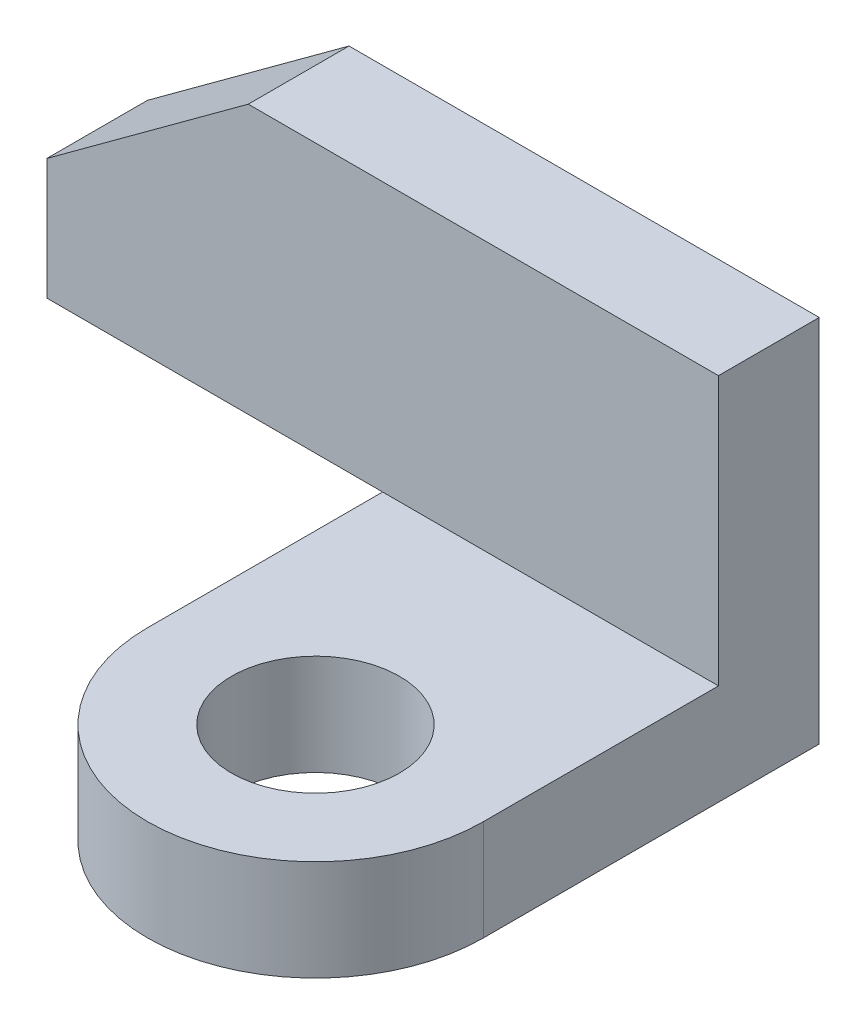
ISO-10303-21;
HEADER;
FILE_DESCRIPTION(('STEP AP214'),'2;1');
FILE_NAME('part.step','',(''),(''),'','','');
FILE_SCHEMA(('AUTOMOTIVE_DESIGN { 1 0 10303 214 1 1 1 1 }'));
ENDSEC;
DATA;
#1=APPLICATION_CONTEXT('core data for automotive mechanical design processes');
#2=APPLICATION_PROTOCOL_DEFINITION('international standard','automotive_design',2000,#1);
#3=PRODUCT_CONTEXT('',#1,'mechanical');
#4=PRODUCT('Part','Part','',(#3));
#5=PRODUCT_RELATED_PRODUCT_CATEGORY('part','',(#4));
#6=PRODUCT_DEFINITION_FORMATION('','',#4);
#7=PRODUCT_DEFINITION_CONTEXT('part definition',#1,'design');
#8=PRODUCT_DEFINITION('design','',#6,#7);
#9=PRODUCT_DEFINITION_SHAPE('','',#8);
#10=(LENGTH_UNIT() NAMED_UNIT(*) SI_UNIT(.MILLI.,.METRE.));
#11=(NAMED_UNIT(*) PLANE_ANGLE_UNIT() SI_UNIT($,.RADIAN.));
#12=(NAMED_UNIT(*) SI_UNIT($,.STERADIAN.) SOLID_ANGLE_UNIT());
#13=UNCERTAINTY_MEASURE_WITH_UNIT(LENGTH_MEASURE(1.E-05),#10,'distance_accuracy_value','');
#14=(GEOMETRIC_REPRESENTATION_CONTEXT(3) GLOBAL_UNCERTAINTY_ASSIGNED_CONTEXT((#13)) GLOBAL_UNIT_ASSIGNED_CONTEXT((#10,
#11,#12)) REPRESENTATION_CONTEXT('',''));
#15=CARTESIAN_POINT('',(0.,0.,0.));
#16=DIRECTION('',(0.,0.,1.));
#17=DIRECTION('',(1.,0.,0.));
#18=AXIS2_PLACEMENT_3D('',#15,#16,#17);
#19=CARTESIAN_POINT('',(-25.,-15.,50.));
#20=DIRECTION('',(0.,1.,0.));
#21=DIRECTION('',(-1.,0.,0.));
#22=AXIS2_PLACEMENT_3D('',#19,#20,#21);
#23=CYLINDRICAL_SURFACE('',#22,25.);
#24=DIRECTION('',(0.,1.,0.));
#25=VECTOR('',#24,1.);
#26=CARTESIAN_POINT('',(-50.,-15.,50.));
#27=LINE('',#26,#25);
#28=CARTESIAN_POINT('',(-50.,-15.,50.));
#29=VERTEX_POINT('',#28);
#30=CARTESIAN_POINT('',(-50.,0.,50.));
#31=VERTEX_POINT('',#30);
#32=EDGE_CURVE('E157',#29,#31,#27,.T.);
#33=ORIENTED_EDGE('',*,*,#32,.F.);
#34=CARTESIAN_POINT('',(-25.,-15.,50.));
#35=DIRECTION('',(0.,-1.,0.));
#36=DIRECTION('',(1.,0.,0.));
#37=AXIS2_PLACEMENT_3D('',#34,#35,#36);
#38=CIRCLE('',#37,25.);
#39=CARTESIAN_POINT('',(0.,-15.,50.));
#40=VERTEX_POINT('',#39);
#41=EDGE_CURVE('E37',#40,#29,#38,.T.);
#42=ORIENTED_EDGE('',*,*,#41,.F.);
#43=DIRECTION('',(0.,1.,0.));
#44=VECTOR('',#43,1.);
#45=CARTESIAN_POINT('',(0.,40.,50.));
#46=LINE('',#45,#44);
#47=CARTESIAN_POINT('',(0.,0.,50.));
#48=VERTEX_POINT('',#47);
#49=EDGE_CURVE('E112',#48,#40,#46,.F.);
#50=ORIENTED_EDGE('',*,*,#49,.F.);
#51=CARTESIAN_POINT('',(-25.,0.,50.));
#52=DIRECTION('',(0.,-1.,0.));
#53=DIRECTION('',(1.,0.,0.));
#54=AXIS2_PLACEMENT_3D('',#51,#52,#53);
#55=CIRCLE('',#54,25.);
#56=EDGE_CURVE('E11',#31,#48,#55,.F.);
#57=ORIENTED_EDGE('',*,*,#56,.F.);
#58=EDGE_LOOP('',(#33,#42,#50,#57));
#59=FACE_BOUND('',#58,.T.);
#60=ADVANCED_FACE('F30',(#59),#23,.T.);
#61=CARTESIAN_POINT('',(0.,0.,15.));
#62=DIRECTION('',(0.,1.,0.));
#63=DIRECTION('',(-1.,0.,0.));
#64=AXIS2_PLACEMENT_3D('',#61,#62,#63);
#65=PLANE('',#64);
#66=DIRECTION('',(0.,0.,-1.));
#67=VECTOR('',#66,1.);
#68=CARTESIAN_POINT('',(-50.,0.,75.));
#69=LINE('',#68,#67);
#70=CARTESIAN_POINT('',(-50.,0.,15.));
#71=VERTEX_POINT('',#70);
#72=CARTESIAN_POINT('',(-50.,0.,0.));
#73=VERTEX_POINT('',#72);
#74=EDGE_CURVE('E160',#71,#73,#69,.T.);
#75=ORIENTED_EDGE('',*,*,#74,.F.);
#76=DIRECTION('',(1.,0.,0.));
#77=VECTOR('',#76,1.);
#78=CARTESIAN_POINT('',(0.,0.,15.));
#79=LINE('',#78,#77);
#80=CARTESIAN_POINT('',(-100.,0.,15.));
#81=VERTEX_POINT('',#80);
#82=EDGE_CURVE('E142',#81,#71,#79,.T.);
#83=ORIENTED_EDGE('',*,*,#82,.F.);
#84=DIRECTION('',(0.,0.,-1.));
#85=VECTOR('',#84,1.);
#86=CARTESIAN_POINT('',(-100.,0.,15.));
#87=LINE('',#86,#85);
#88=CARTESIAN_POINT('',(-100.,0.,0.));
#89=VERTEX_POINT('',#88);
#90=EDGE_CURVE('E145',#81,#89,#87,.T.);
#91=ORIENTED_EDGE('',*,*,#90,.T.);
#92=DIRECTION('',(1.,0.,0.));
#93=VECTOR('',#92,1.);
#94=CARTESIAN_POINT('',(0.,0.,0.));
#95=LINE('',#94,#93);
#96=EDGE_CURVE('E154',#89,#73,#95,.T.);
#97=ORIENTED_EDGE('',*,*,#96,.T.);
#98=EDGE_LOOP('',(#75,#83,#91,#97));
#99=FACE_BOUND('',#98,.T.);
#100=ADVANCED_FACE('F198',(#99),#65,.F.);
#101=CARTESIAN_POINT('',(0.,40.,15.));
#102=DIRECTION('',(-1.,0.,0.));
#103=DIRECTION('',(0.,-1.,0.));
#104=AXIS2_PLACEMENT_3D('',#101,#102,#103);
#105=PLANE('',#104);
#106=DIRECTION('',(0.,0.,1.));
#107=VECTOR('',#106,1.);
#108=CARTESIAN_POINT('',(0.,0.,0.));
#109=LINE('',#108,#107);
#110=CARTESIAN_POINT('',(0.,0.,15.));
#111=VERTEX_POINT('',#110);
#112=EDGE_CURVE('E122',#111,#48,#109,.T.);
#113=ORIENTED_EDGE('',*,*,#112,.T.);
#114=ORIENTED_EDGE('',*,*,#49,.T.);
#115=DIRECTION('',(0.,0.,1.));
#116=VECTOR('',#115,1.);
#117=CARTESIAN_POINT('',(0.,-15.,0.));
#118=LINE('',#117,#116);
#119=CARTESIAN_POINT('',(0.,-15.,0.));
#120=VERTEX_POINT('',#119);
#121=EDGE_CURVE('E109',#120,#40,#118,.T.);
#122=ORIENTED_EDGE('',*,*,#121,.F.);
#123=DIRECTION('',(0.,1.,0.));
#124=VECTOR('',#123,1.);
#125=CARTESIAN_POINT('',(0.,40.,0.));
#126=LINE('',#125,#124);
#127=CARTESIAN_POINT('',(0.,40.,0.));
#128=VERTEX_POINT('',#127);
#129=EDGE_CURVE('E95',#120,#128,#126,.T.);
#130=ORIENTED_EDGE('',*,*,#129,.T.);
#131=DIRECTION('',(0.,0.,-1.));
#132=VECTOR('',#131,1.);
#133=CARTESIAN_POINT('',(0.,40.,15.));
#134=LINE('',#133,#132);
#135=CARTESIAN_POINT('',(0.,40.,15.));
#136=VERTEX_POINT('',#135);
#137=EDGE_CURVE('E168',#136,#128,#134,.T.);
#138=ORIENTED_EDGE('',*,*,#137,.F.);
#139=DIRECTION('',(0.,1.,0.));
#140=VECTOR('',#139,1.);
#141=CARTESIAN_POINT('',(0.,40.,15.));
#142=LINE('',#141,#140);
#143=EDGE_CURVE('E137',#111,#136,#142,.T.);
#144=ORIENTED_EDGE('',*,*,#143,.F.);
#145=EDGE_LOOP('',(#113,#114,#122,#130,#138,#144));
#146=FACE_BOUND('',#145,.T.);
#147=ADVANCED_FACE('F111',(#146),#105,.F.);
#148=CARTESIAN_POINT('',(-70.,40.,15.));
#149=DIRECTION('',(0.,-1.,0.));
#150=DIRECTION('',(0.,0.,-1.));
#151=AXIS2_PLACEMENT_3D('',#148,#149,#150);
#152=PLANE('',#151);
#153=DIRECTION('',(-1.,0.,0.));
#154=VECTOR('',#153,1.);
#155=CARTESIAN_POINT('',(-70.,40.,0.));
#156=LINE('',#155,#154);
#157=CARTESIAN_POINT('',(-70.,40.,0.));
#158=VERTEX_POINT('',#157);
#159=EDGE_CURVE('E102',#128,#158,#156,.T.);
#160=ORIENTED_EDGE('',*,*,#159,.T.);
#161=DIRECTION('',(0.,0.,-1.));
#162=VECTOR('',#161,1.);
#163=CARTESIAN_POINT('',(-70.,40.,15.));
#164=LINE('',#163,#162);
#165=CARTESIAN_POINT('',(-70.,40.,15.));
#166=VERTEX_POINT('',#165);
#167=EDGE_CURVE('E181',#166,#158,#164,.T.);
#168=ORIENTED_EDGE('',*,*,#167,.F.);
#169=DIRECTION('',(-1.,0.,0.));
#170=VECTOR('',#169,1.);
#171=CARTESIAN_POINT('',(-70.,40.,15.));
#172=LINE('',#171,#170);
#173=EDGE_CURVE('E134',#136,#166,#172,.T.);
#174=ORIENTED_EDGE('',*,*,#173,.F.);
#175=ORIENTED_EDGE('',*,*,#137,.T.);
#176=EDGE_LOOP('',(#160,#168,#174,#175));
#177=FACE_BOUND('',#176,.T.);
#178=ADVANCED_FACE('F187',(#177),#152,.F.);
#179=CARTESIAN_POINT('',(-100.,18.,15.));
#180=DIRECTION('',(0.591363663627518,-0.806404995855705,0.));
#181=DIRECTION('',(0.806404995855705,0.591363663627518,0.));
#182=AXIS2_PLACEMENT_3D('',#179,#180,#181);
#183=PLANE('',#182);
#184=DIRECTION('',(-0.806404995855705,-0.591363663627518,0.));
#185=VECTOR('',#184,1.);
#186=CARTESIAN_POINT('',(-100.,18.,0.));
#187=LINE('',#186,#185);
#188=CARTESIAN_POINT('',(-100.,18.,0.));
#189=VERTEX_POINT('',#188);
#190=EDGE_CURVE('E200',#158,#189,#187,.T.);
#191=ORIENTED_EDGE('',*,*,#190,.T.);
#192=DIRECTION('',(0.,0.,-1.));
#193=VECTOR('',#192,1.);
#194=CARTESIAN_POINT('',(-100.,18.,15.));
#195=LINE('',#194,#193);
#196=CARTESIAN_POINT('',(-100.,18.,15.));
#197=VERTEX_POINT('',#196);
#198=EDGE_CURVE('E179',#197,#189,#195,.T.);
#199=ORIENTED_EDGE('',*,*,#198,.F.);
#200=DIRECTION('',(-0.806404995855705,-0.591363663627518,0.));
#201=VECTOR('',#200,1.);
#202=CARTESIAN_POINT('',(-100.,18.,15.));
#203=LINE('',#202,#201);
#204=EDGE_CURVE('E136',#166,#197,#203,.T.);
#205=ORIENTED_EDGE('',*,*,#204,.F.);
#206=ORIENTED_EDGE('',*,*,#167,.T.);
#207=EDGE_LOOP('',(#191,#199,#205,#206));
#208=FACE_BOUND('',#207,.T.);
#209=ADVANCED_FACE('F203',(#208),#183,.F.);
#210=CARTESIAN_POINT('',(-100.,0.,15.));
#211=DIRECTION('',(1.,0.,0.));
#212=DIRECTION('',(0.,0.,-1.));
#213=AXIS2_PLACEMENT_3D('',#210,#211,#212);
#214=PLANE('',#213);
#215=DIRECTION('',(0.,-1.,0.));
#216=VECTOR('',#215,1.);
#217=CARTESIAN_POINT('',(-100.,0.,0.));
#218=LINE('',#217,#216);
#219=EDGE_CURVE('E171',#189,#89,#218,.T.);
#220=ORIENTED_EDGE('',*,*,#219,.T.);
#221=ORIENTED_EDGE('',*,*,#90,.F.);
#222=DIRECTION('',(0.,-1.,0.));
#223=VECTOR('',#222,1.);
#224=CARTESIAN_POINT('',(-100.,0.,15.));
#225=LINE('',#224,#223);
#226=EDGE_CURVE('E139',#197,#81,#225,.T.);
#227=ORIENTED_EDGE('',*,*,#226,.F.);
#228=ORIENTED_EDGE('',*,*,#198,.T.);
#229=EDGE_LOOP('',(#220,#221,#227,#228));
#230=FACE_BOUND('',#229,.T.);
#231=ADVANCED_FACE('F204',(#230),#214,.F.);
#232=CARTESIAN_POINT('',(0.,40.,15.));
#233=DIRECTION('',(0.,0.,1.));
#234=DIRECTION('',(1.,0.,0.));
#235=AXIS2_PLACEMENT_3D('',#232,#233,#234);
#236=PLANE('',#235);
#237=ORIENTED_EDGE('',*,*,#143,.T.);
#238=ORIENTED_EDGE('',*,*,#173,.T.);
#239=ORIENTED_EDGE('',*,*,#204,.T.);
#240=ORIENTED_EDGE('',*,*,#226,.T.);
#241=ORIENTED_EDGE('',*,*,#82,.T.);
#242=EDGE_CURVE('E141',#71,#111,#79,.T.);
#243=ORIENTED_EDGE('',*,*,#242,.T.);
#244=EDGE_LOOP('',(#237,#238,#239,#240,#241,#243));
#245=FACE_BOUND('',#244,.T.);
#246=ADVANCED_FACE('F193',(#245),#236,.T.);
#247=CARTESIAN_POINT('',(0.,40.,0.));
#248=DIRECTION('',(0.,0.,1.));
#249=DIRECTION('',(1.,0.,0.));
#250=AXIS2_PLACEMENT_3D('',#247,#248,#249);
#251=PLANE('',#250);
#252=ORIENTED_EDGE('',*,*,#129,.F.);
#253=DIRECTION('',(1.,0.,0.));
#254=VECTOR('',#253,1.);
#255=CARTESIAN_POINT('',(-50.,-15.,0.));
#256=LINE('',#255,#254);
#257=CARTESIAN_POINT('',(-50.,-15.,0.));
#258=VERTEX_POINT('',#257);
#259=EDGE_CURVE('E100',#258,#120,#256,.T.);
#260=ORIENTED_EDGE('',*,*,#259,.F.);
#261=DIRECTION('',(0.,1.,0.));
#262=VECTOR('',#261,1.);
#263=CARTESIAN_POINT('',(-50.,-15.,0.));
#264=LINE('',#263,#262);
#265=EDGE_CURVE('E106',#258,#73,#264,.T.);
#266=ORIENTED_EDGE('',*,*,#265,.T.);
#267=ORIENTED_EDGE('',*,*,#96,.F.);
#268=ORIENTED_EDGE('',*,*,#219,.F.);
#269=ORIENTED_EDGE('',*,*,#190,.F.);
#270=ORIENTED_EDGE('',*,*,#159,.F.);
#271=EDGE_LOOP('',(#252,#260,#266,#267,#268,#269,#270));
#272=FACE_BOUND('',#271,.T.);
#273=ADVANCED_FACE('F97',(#272),#251,.F.);
#274=CARTESIAN_POINT('',(0.,-15.,0.));
#275=DIRECTION('',(0.,-1.,0.));
#276=DIRECTION('',(1.,0.,0.));
#277=AXIS2_PLACEMENT_3D('',#274,#275,#276);
#278=PLANE('',#277);
#279=ORIENTED_EDGE('',*,*,#121,.T.);
#280=ORIENTED_EDGE('',*,*,#41,.T.);
#281=DIRECTION('',(0.,0.,-1.));
#282=VECTOR('',#281,1.);
#283=CARTESIAN_POINT('',(-50.,-15.,75.));
#284=LINE('',#283,#282);
#285=EDGE_CURVE('E114',#29,#258,#284,.T.);
#286=ORIENTED_EDGE('',*,*,#285,.T.);
#287=ORIENTED_EDGE('',*,*,#259,.T.);
#288=EDGE_LOOP('',(#279,#280,#286,#287));
#289=FACE_BOUND('',#288,.T.);
#290=CARTESIAN_POINT('',(-25.,-15.,50.));
#291=DIRECTION('',(0.,-1.,0.));
#292=DIRECTION('',(1.,0.,0.));
#293=AXIS2_PLACEMENT_3D('',#290,#291,#292);
#294=CIRCLE('',#293,12.5);
#295=CARTESIAN_POINT('',(-12.5,-15.,50.));
#296=VERTEX_POINT('',#295);
#297=EDGE_CURVE('E133',#296,#296,#294,.T.);
#298=ORIENTED_EDGE('',*,*,#297,.F.);
#299=EDGE_LOOP('',(#298));
#300=FACE_BOUND('',#299,.T.);
#301=ADVANCED_FACE('F116',(#289,#300),#278,.T.);
#302=CARTESIAN_POINT('',(0.,0.,0.));
#303=DIRECTION('',(0.,-1.,0.));
#304=DIRECTION('',(1.,0.,0.));
#305=AXIS2_PLACEMENT_3D('',#302,#303,#304);
#306=PLANE('',#305);
#307=EDGE_CURVE('E120',#31,#71,#69,.T.);
#308=ORIENTED_EDGE('',*,*,#307,.F.);
#309=ORIENTED_EDGE('',*,*,#56,.T.);
#310=ORIENTED_EDGE('',*,*,#112,.F.);
#311=ORIENTED_EDGE('',*,*,#242,.F.);
#312=EDGE_LOOP('',(#308,#309,#310,#311));
#313=FACE_BOUND('',#312,.T.);
#314=CARTESIAN_POINT('',(-25.,0.,50.));
#315=DIRECTION('',(0.,-1.,0.));
#316=DIRECTION('',(1.,0.,0.));
#317=AXIS2_PLACEMENT_3D('',#314,#315,#316);
#318=CIRCLE('',#317,12.5);
#319=CARTESIAN_POINT('',(-12.5,0.,50.));
#320=VERTEX_POINT('',#319);
#321=EDGE_CURVE('E125',#320,#320,#318,.T.);
#322=ORIENTED_EDGE('',*,*,#321,.T.);
#323=EDGE_LOOP('',(#322));
#324=FACE_BOUND('',#323,.T.);
#325=ADVANCED_FACE('F191',(#313,#324),#306,.F.);
#326=CARTESIAN_POINT('',(-50.,-15.,75.));
#327=DIRECTION('',(1.,0.,0.));
#328=DIRECTION('',(0.,0.,-1.));
#329=AXIS2_PLACEMENT_3D('',#326,#327,#328);
#330=PLANE('',#329);
#331=ORIENTED_EDGE('',*,*,#285,.F.);
#332=ORIENTED_EDGE('',*,*,#32,.T.);
#333=ORIENTED_EDGE('',*,*,#307,.T.);
#334=ORIENTED_EDGE('',*,*,#74,.T.);
#335=ORIENTED_EDGE('',*,*,#265,.F.);
#336=EDGE_LOOP('',(#331,#332,#333,#334,#335));
#337=FACE_BOUND('',#336,.T.);
#338=ADVANCED_FACE('F162',(#337),#330,.F.);
#339=CARTESIAN_POINT('',(-25.,-15.,50.));
#340=DIRECTION('',(0.,1.,0.));
#341=DIRECTION('',(-1.,0.,0.));
#342=AXIS2_PLACEMENT_3D('',#339,#340,#341);
#343=CYLINDRICAL_SURFACE('',#342,12.5);
#344=ORIENTED_EDGE('',*,*,#297,.T.);
#345=EDGE_LOOP('',(#344));
#346=FACE_BOUND('',#345,.T.);
#347=ORIENTED_EDGE('',*,*,#321,.F.);
#348=EDGE_LOOP('',(#347));
#349=FACE_BOUND('',#348,.T.);
#350=ADVANCED_FACE('F226',(#346,#349),#343,.F.);
#351=CLOSED_SHELL('',(#60,#100,#147,#178,#209,#231,#246,#273,#301,#325,#338,#350));
#352=MANIFOLD_SOLID_BREP('B2',#351);
#353=ADVANCED_BREP_SHAPE_REPRESENTATION('',(#18,#352),#14);
#354=SHAPE_DEFINITION_REPRESENTATION(#9,#353);
ENDSEC;
END-ISO-10303-21;
